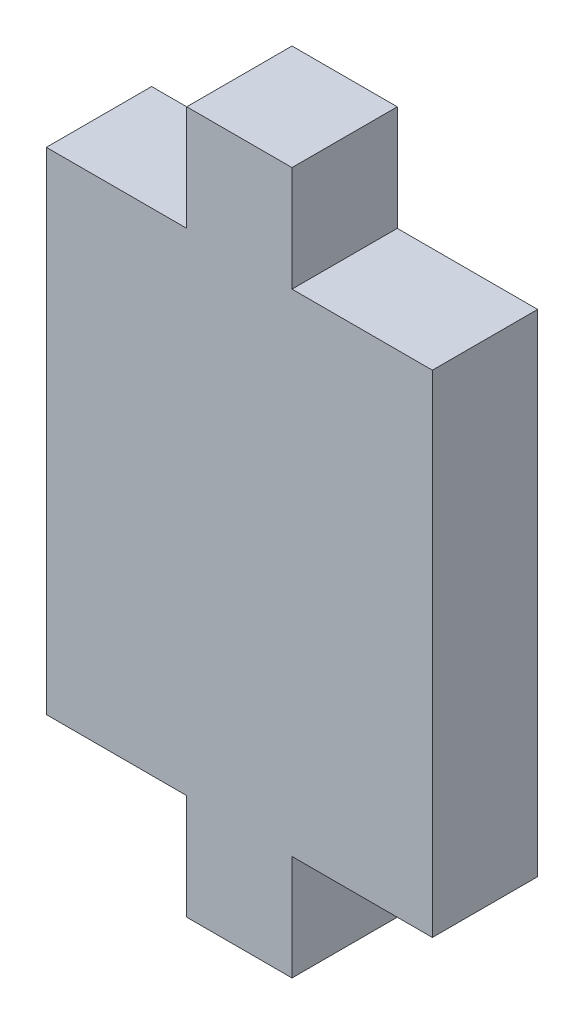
from build123d import *

# Parameters (mm, degrees)
SKETCH1_W           = 69.85
SKETCH1_H           = 88.9
SKETCH1_W_2         = 9.525
SKETCH1_H_2         = 19.05
BOSS_EXTRUDE1_DEPTH = 19.05


with BuildPart() as part:
    # Sketch1 → Boss-Extrude1 (new body)
    with BuildSketch(Plane.XY):
        with Locations((34.925, 44.45)):
            Rectangle(SKETCH1_W, SKETCH1_H)
        with Locations((39.6875, -9.525)):
            Rectangle(SKETCH1_W_2, SKETCH1_H_2)
        with Locations((30.1625, -9.525)):
            Rectangle(SKETCH1_W_2, SKETCH1_H_2)
        with Locations((39.6875, 98.425)):
            Rectangle(SKETCH1_W_2, SKETCH1_H_2)
        with Locations((30.1625, 98.425)):
            Rectangle(SKETCH1_W_2, SKETCH1_H_2)
    extrude(amount=BOSS_EXTRUDE1_DEPTH)


solid = part.part
